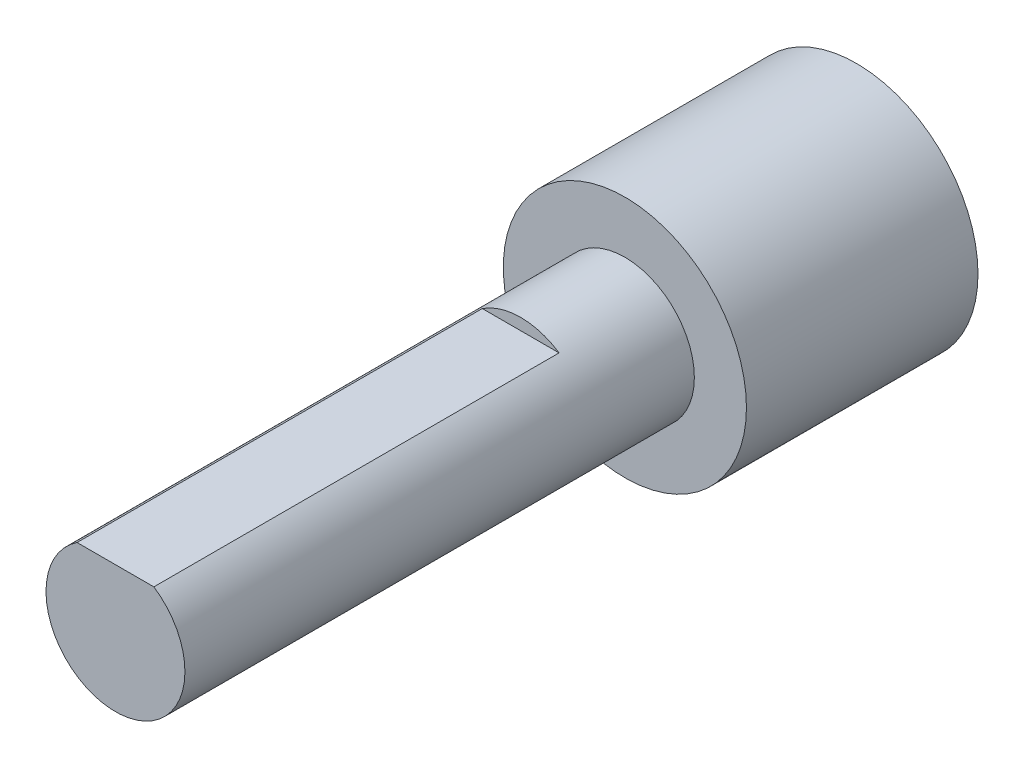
from build123d import *

# Parameters (mm, degrees)
SCHIZZO1_R                   = 5.25
ESTRUSIONE_ESTRUSIONE1_DEPTH = 10
SCHIZZO2_R                   = 3
ESTRUSIONE_ESTRUSIONE2_DEPTH = 22
SCHIZZO3_W                   = 6
SCHIZZO3_H                   = 1
TAGLIO_ESTRUSIONE1_DEPTH     = 17.5


with BuildPart() as part:
    # Schizzo1 → Estrusione-Estrusione1 (new body)
    with BuildSketch(Plane.XY):
        Circle(SCHIZZO1_R)
    extrude(amount=ESTRUSIONE_ESTRUSIONE1_DEPTH)

    # Schizzo2 → Estrusione-Estrusione2 (add)
    with BuildSketch(Plane.XY.offset(10)):
        Circle(SCHIZZO2_R)
    extrude(amount=ESTRUSIONE_ESTRUSIONE2_DEPTH)

    # Schizzo3 → Taglio-Estrusione1 (cut)
    with BuildSketch(Plane.XY.offset(32)):
        with Locations((0, 3)):
            Rectangle(SCHIZZO3_W, SCHIZZO3_H)
    extrude(amount=-TAGLIO_ESTRUSIONE1_DEPTH, mode=Mode.SUBTRACT)


solid = part.part
